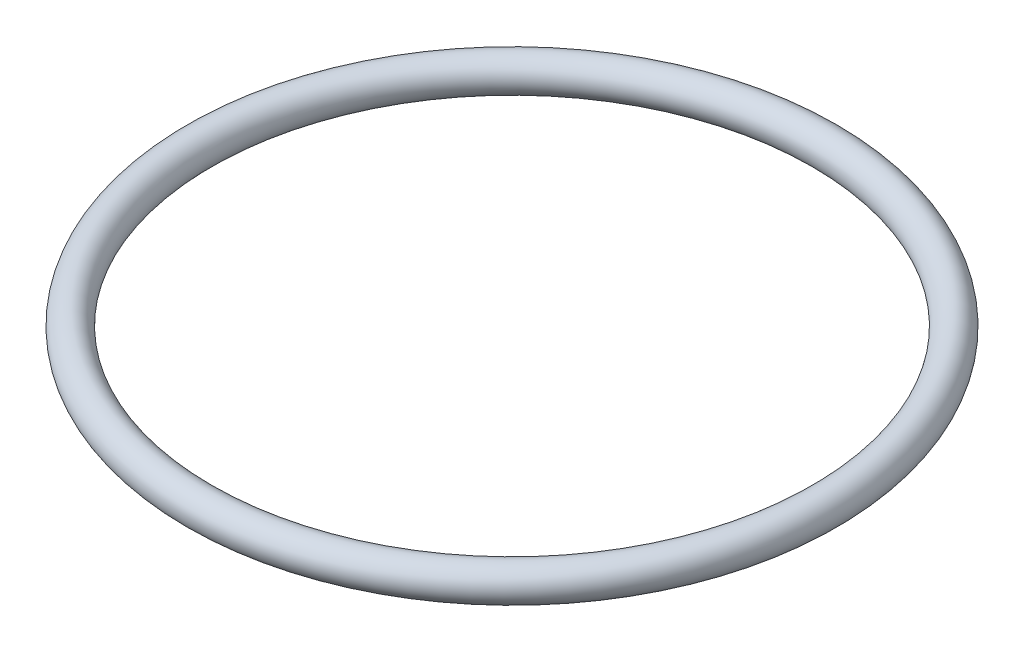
from build123d import *

# Parameters (mm, degrees)
SKETCH1_R = 1.3081


with BuildPart() as part:
    # Sketch1 → Base-Revolve (revolve)
    with BuildSketch(Plane.XY, mode=Mode.PRIVATE) as base_revolve_sk:
        with Locations((23.7998, 0)):
            Circle(SKETCH1_R)
    revolve(base_revolve_sk.sketch.rotate(Axis((0, 0, 0), (0, 1, 0)), 90), axis=Axis((0, 0, 0), (0, 1, 0)))


solid = part.part
